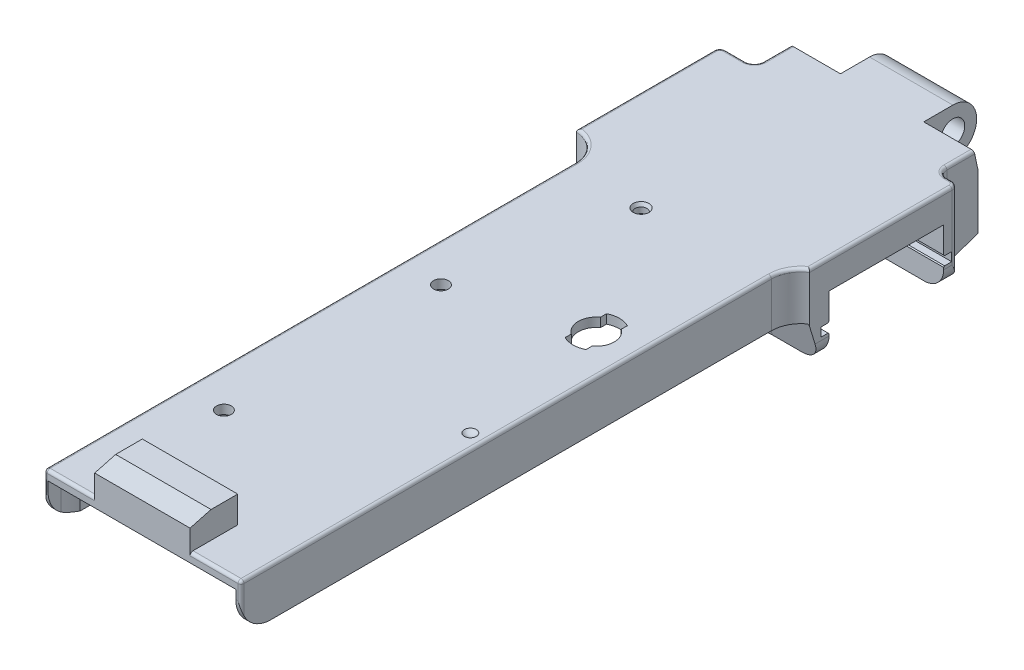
from build123d import *

# Parameters (mm, degrees)
SKETCH_1_R          = 3.175
EXTRUDE_1_DEPTH     = 63.3984
SKETCH_2_R          = 1.9685
SKETCH_2_R_2        = 1.5748
CUT_EXTRUDE_1_DEPTH = 217.447445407
CUT_EXTRUDE_2_DEPTH = 10.4902
CUT_EXTRUDE_3_DEPTH = 22.479
CUT_EXTRUDE_4_DEPTH = 18.7452
SKETCH_6_W          = 13.5763
SKETCH_6_H          = 7.112
SKETCH_6_W_2        = 13.4239
CUT_EXTRUDE_5_DEPTH = 209.938252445
CUT_EXTRUDE_6_DEPTH = 20.7772
CUT_EXTRUDE_7_DEPTH = 13.6906
CUT_EXTRUDE_START   = 12.8524
SKETCH_9_R          = 16.66875
CUT_EXTRUDE_8_DEPTH = 4.953
CHAMFER_1_SIZE      = 0.889
CHAMFER_1_SIZE2     = 0.513264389
CUT_EXTRUDE_9_DEPTH = 222.032085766
FILLET_1_R          = 0.79375


with BuildPart() as part:
    # Sketch 1 → Extrude 1 (new body)
    with BuildSketch(Plane(origin=(0, 0, 0), x_dir=(0, 0, -1), z_dir=(1, 0, 0))):
        with BuildLine():
            Line((0, 6.35), (-192.024, 6.35))
            Line((-192.024, 6.35), (-192.024, 13.462))
            Line((-192.024, 13.462), (-199.13114866, 13.462))
            Line((-199.13114866, 13.462), (-204.724, 11.9634))
            Line((-204.724, 11.9634), (-204.724, 6.35))
            Line((-204.724, 6.35), (-204.724, 1.5875))
            ThreePointArc((-204.724, 1.5875), (-202.399160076, -4.025160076), (-196.7865, -6.35))
            Line((-196.7865, -6.35), (-84.169675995, -6.35))
            Line((-84.169675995, -6.35), (-80.9625, -16.8402))
            Line((-80.9625, -16.8402), (-51.7144, -16.8402))
            Line((-51.7144, -16.8402), (-51.7144, -11.1252))
            Line((-51.7144, -11.1252), (-51.9684, -10.8712))
            Line((-51.9684, -10.8712), (-53.848, -10.8712))
            Line((-53.848, -10.8712), (-53.848, -8.5344))
            Line((-53.848, -8.5344), (-51.9684, -8.5344))
            Line((-51.9684, -8.5344), (-51.7144, -8.2804))
            Line((-51.7144, -8.2804), (-51.7144, -1.2954))
            Line((-51.7144, -1.2954), (-21.1836, -1.2954))
            Line((-21.1836, -1.2954), (-21.1836, -8.2804))
            Line((-21.1836, -8.2804), (-20.9296, -8.5344))
            Line((-20.9296, -8.5344), (-19.05, -8.5344))
            Line((-19.05, -8.5344), (-19.05, -10.8712))
            Line((-19.05, -10.8712), (-20.9296, -10.8712))
            Line((-20.9296, -10.8712), (-21.1836, -11.1252))
            Line((-21.1836, -11.1252), (-21.1836, -16.8402))
            Line((-21.1836, -16.8402), (-17.3736, -16.8402))
            Line((-17.3736, -16.8402), (-6.7056, -13.166913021))
            Line((-6.7056, -13.166913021), (-6.7056, -6.35))
            Line((-6.7056, -6.35), (0, -6.35))
            ThreePointArc((0, -6.35), (6.35, 0), (0, 6.35))
        make_face()
        Circle(SKETCH_1_R, mode=Mode.SUBTRACT)
    extrude(amount=EXTRUDE_1_DEPTH)

    # Sketch 2 → Cut-Extrude 1 (cut, through all)
    with BuildSketch(Plane(origin=(0, 13.462, 0), x_dir=(1, 0, 0), z_dir=(0, 1, 0))):
        with Locations(Location((17.9578, -167.4114, 0), (0, 0, 270))):
            Circle(SKETCH_2_R)
        with Locations(Location((17.9578, -109.601, 0), (0, 0, 270))):
            Circle(SKETCH_2_R)
        with Locations(Location((26.8732, -65.2272, 0), (0, 0, 270))):
            Circle(SKETCH_2_R_2)
        with BuildLine():
            Line((0, 6.35), (22.479, 6.35))
            Line((22.479, 6.35), (22.479, -6.7056))
            Line((22.479, -6.7056), (9.1694, -6.7056))
            Line((9.1694, -6.7056), (9.1694, -14.99235))
            ThreePointArc((9.1694, -14.99235), (8.471948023, -16.676148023), (6.78815, -17.3736))
            Line((6.78815, -17.3736), (1.5875, -17.3736))
            ThreePointArc((1.5875, -17.3736), (0.464967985, -17.838567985), (0, -18.9611))
            Line((0, -18.9611), (0, 6.35))
        make_face()
        with BuildLine():
            Line((0, -204.724), (8.23595, -204.724))
            ThreePointArc((8.23595, -204.724), (7.674683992, -204.491516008), (7.4422, -203.93025))
            Line((7.4422, -203.93025), (7.4422, -63.5))
            ThreePointArc((7.4422, -63.5), (5.289825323, -58.065275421), (0, -55.577968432))
            Line((0, -55.577968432), (0, -204.724))
        make_face()
        with BuildLine():
            Line((63.3984, 6.35), (63.3984, -18.9611))
            ThreePointArc((63.3984, -18.9611), (62.933432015, -17.838567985), (61.8109, -17.3736))
            Line((61.8109, -17.3736), (60.44565, -17.3736))
            ThreePointArc((60.44565, -17.3736), (58.761851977, -16.676148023), (58.0644, -14.99235))
            Line((58.0644, -14.99235), (58.0644, -6.7056))
            Line((58.0644, -6.7056), (44.6532, -6.7056))
            Line((44.6532, -6.7056), (44.6532, 6.35))
            Line((44.6532, 6.35), (63.3984, 6.35))
        make_face()
        with BuildLine():
            Line((59.8424, -203.93025), (59.8424, -63.5))
            ThreePointArc((59.8424, -63.5), (60.787687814, -59.743289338), (63.3984, -56.881362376))
            Line((63.3984, -56.881362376), (63.3984, -204.724))
            Line((63.3984, -204.724), (59.04865, -204.724))
            ThreePointArc((59.04865, -204.724), (59.609916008, -204.491516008), (59.8424, -203.93025))
        make_face()
        with BuildLine():
            Line((46.6598, -94.218191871), (46.6598, -95.837516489))
            ThreePointArc((46.6598, -95.837516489), (44.65955, -99.7204), (46.6598, -103.603283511))
            Line((46.6598, -103.603283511), (46.6598, -105.222608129))
            ThreePointArc((46.6598, -105.222608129), (49.4284, -105.8799), (52.197, -105.222608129))
            Line((52.197, -105.222608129), (52.197, -103.603283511))
            ThreePointArc((52.197, -103.603283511), (54.19725, -99.7204), (52.197, -95.837516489))
            Line((52.197, -95.837516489), (52.197, -94.218191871))
            ThreePointArc((52.197, -94.218191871), (49.4284, -93.5609), (46.6598, -94.218191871))
        make_face()
    extrude(amount=-CUT_EXTRUDE_1_DEPTH, mode=Mode.SUBTRACT)

    # Sketch 3 → Cut-Extrude 2 (cut)
    with BuildSketch(Plane.XZ.offset(16.8402)):
        with BuildLine():
            Line((10.6934, -6.35), (56.7944, -6.35))
            Line((56.7944, -6.35), (56.7944, 7.8486))
            ThreePointArc((56.7944, 7.8486), (54.004592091, 14.583792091), (47.2694, 17.3736))
            Line((47.2694, 17.3736), (20.2184, 17.3736))
            ThreePointArc((20.2184, 17.3736), (13.483207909, 14.583792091), (10.6934, 7.8486))
            Line((10.6934, 7.8486), (10.6934, -6.35))
        make_face()
    extrude(amount=-CUT_EXTRUDE_2_DEPTH, mode=Mode.SUBTRACT)

    # Sketch 4 → Cut-Extrude 3 (cut)
    with BuildSketch(Plane.ZY):
        Polygon((6.7056, 1.450598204), (6.7056, 6.35), (7.747, 6.35), align=None)
    extrude(amount=-CUT_EXTRUDE_3_DEPTH, mode=Mode.SUBTRACT)

    # Sketch 5 → Cut-Extrude 4 (cut)
    with BuildSketch(Plane(origin=(63.3984, 0, 0), x_dir=(0, 0, -1), z_dir=(1, 0, 0))):
        Polygon((-6.7056, 1.450598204), (-6.7056, 6.35), (-7.747, 6.35), align=None)
    extrude(amount=-CUT_EXTRUDE_4_DEPTH, mode=Mode.SUBTRACT)

    # Sketch 6 → Cut-Extrude 5 (cut, through all)
    with BuildSketch(Plane(origin=(0, 0, 192.024), x_dir=(-1, 0, 0), z_dir=(0, 0, -1))):
        with Locations((-53.05425, 9.906)):
            Rectangle(SKETCH_6_W, SKETCH_6_H)
        with Locations((-14.15415, 9.906)):
            Rectangle(SKETCH_6_W_2, SKETCH_6_H)
    extrude(amount=-CUT_EXTRUDE_5_DEPTH, mode=Mode.SUBTRACT)

    # Sketch 7 → Cut-Extrude 6 (cut)
    with BuildSketch(Plane(origin=(0, -16.8402, 0), x_dir=(-1, 0, 0), z_dir=(0, -1, 0))):
        with BuildLine():
            Line((-55.6006, -178.59375), (-55.6006, -102.069179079))
            ThreePointArc((-55.6006, -102.069179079), (-56.0324, -99.7204), (-55.6006, -97.371620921))
            Line((-55.6006, -97.371620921), (-55.6006, -64.135))
            ThreePointArc((-55.6006, -64.135), (-52.810792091, -57.399807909), (-46.0756, -54.61))
            Line((-46.0756, -54.61), (-21.1836, -54.61))
            ThreePointArc((-21.1836, -54.61), (-14.448407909, -57.399807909), (-11.6586, -64.135))
            Line((-11.6586, -64.135), (-11.6586, -194.070997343))
            ThreePointArc((-11.6586, -194.070997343), (-9.2766277, -197.296074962), (-8.4328, -201.215625))
            Line((-8.4328, -201.215625), (-8.4328, -204.724))
            Line((-8.4328, -204.724), (-58.4454, -204.724))
            Line((-58.4454, -204.724), (-58.4454, -201.215625))
            ThreePointArc((-58.4454, -201.215625), (-57.402464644, -196.882011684), (-54.50205, -193.497412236))
            ThreePointArc((-54.50205, -193.497412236), (-53.535245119, -192.369212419), (-53.1876, -190.924674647))
            Line((-53.1876, -190.924674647), (-53.1876, -186.041409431))
            ThreePointArc((-53.1876, -186.041409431), (-53.342175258, -185.062808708), (-53.79085, -184.179494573))
            ThreePointArc((-53.79085, -184.179494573), (-55.136874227, -181.529552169), (-55.6006, -178.59375))
        make_face()
    extrude(amount=-CUT_EXTRUDE_6_DEPTH, mode=Mode.SUBTRACT)

    # Sketch 8 → Cut-Extrude 7 (cut)
    with BuildSketch(Plane.XZ.offset(16.8402)):
        with BuildLine():
            Line((58.4454, 189.70625), (58.4454, 64.135))
            ThreePointArc((58.4454, 64.135), (55.655592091, 57.399807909), (48.9204, 54.61))
            Line((48.9204, 54.61), (22.479, 54.61))
            Line((22.479, 54.61), (22.479, 65.484375))
            Line((22.479, 65.484375), (18.3134, 65.484375))
            ThreePointArc((18.3134, 65.484375), (11.578207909, 68.274182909), (8.7884, 75.009375))
            Line((8.7884, 75.009375), (8.7884, 189.70625))
            ThreePointArc((8.7884, 189.70625), (8.935587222, 191.374258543), (9.3726, 192.990716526))
            Line((9.3726, 192.990716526), (9.3726, 197.090098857))
            ThreePointArc((9.3726, 197.090098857), (8.670721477, 199.100016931), (8.4328, 201.215625))
            Line((8.4328, 201.215625), (8.4328, 204.724))
            Line((8.4328, 204.724), (58.4454, 204.724))
            Line((58.4454, 204.724), (58.4454, 201.215625))
            ThreePointArc((58.4454, 201.215625), (58.400845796, 200.295422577), (58.2676, 199.383828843))
            Line((58.2676, 199.383828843), (58.2676, 191.538046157))
            ThreePointArc((58.2676, 191.538046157), (58.400845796, 190.626452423), (58.4454, 189.70625))
        make_face()
    extrude(amount=-CUT_EXTRUDE_7_DEPTH, mode=Mode.SUBTRACT)

    # Sketch 9 → Cut-Extrude 8 (cut)
    with BuildSketch(Plane.XZ.offset(-6.35).offset(CUT_EXTRUDE_START)):
        with Locations((41.3131, 60.300118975)):
            Circle(SKETCH_9_R)
    extrude(amount=-CUT_EXTRUDE_8_DEPTH, mode=Mode.SUBTRACT)

    # Chamfer 1
    chamfer_1_edges = [part.edges().sort_by_distance(p)[0] for p in [
        (26.8732, 6.35, 63.6524),
    ]]
    chamfer_1_side = [part.faces().sort_by_distance(p)[0] for p in [
        (26.8732, 5.1435, 63.6524),
    ]]
    chamfer(chamfer_1_edges, length=CHAMFER_1_SIZE, length2=CHAMFER_1_SIZE2, reference=chamfer_1_side[0])

    # Sweep 1: sweep along a path in Sketch 10
    with BuildLine(Plane(origin=(63.3984, 0, 0), x_dir=(0, 0, -1), z_dir=(1, 0, 0))) as sweep_1_path:
        Line((-53.848, -16.8402), (-57.055175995, -6.35))
    # Sketch 11 → Sweep 1 (sweep, cut)
    with BuildSketch(Plane.XZ.offset(16.8402)):
        with BuildLine():
            Line((50.462672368, 53.848), (63.3984, 53.848))
            Line((63.3984, 53.848), (63.3984, 98.228236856))
            Line((63.3984, 98.228236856), (46.72965, 98.228236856))
            Line((46.72965, 98.228236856), (46.72965, 54.61))
            ThreePointArc((46.72965, 54.61), (48.557672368, 54.04044408), (50.462672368, 53.848))
        make_face()
    sweep(path=sweep_1_path.line, mode=Mode.SUBTRACT)

    # Sketch 12 → Cut-Extrude 9 (cut, through all)
    with BuildSketch(Plane.XY.offset(204.724)):
        with BuildLine():
            Line((63.3984, -11.680825), (63.3984, -16.8402))
            Line((63.3984, -16.8402), (58.239025, -16.8402))
            ThreePointArc((58.239025, -16.8402), (61.887254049, -15.329054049), (63.3984, -11.680825))
        make_face()
        with BuildLine():
            Line((5.159375, -16.8402), (0, -16.8402))
            Line((0, -16.8402), (0, -11.680825))
            ThreePointArc((0, -11.680825), (1.511145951, -15.329054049), (5.159375, -16.8402))
        make_face()
    extrude(amount=-CUT_EXTRUDE_9_DEPTH, mode=Mode.SUBTRACT)

    # Fillet 1
    fillet_1_edges = [part.edges().sort_by_distance(p)[0] for p in [
        (60.787687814, 6.35, 59.743289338),
        (59.8424, 6.35, 133.715125),
        (5.289825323, 6.35, 58.065275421),
        (7.4422, 6.35, 133.715125),
        (63.3984, 6.35, 37.921231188),
        (58.0644, 6.35, 11.369675),
        (58.761851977, 6.35, 16.676148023),
        (61.128275, 6.35, 17.3736),
        (62.933432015, 6.35, 17.838567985),
        (9.1694, 6.35, 11.369675),
        (59.609916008, 6.35, 204.491516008),
        (52.657375, 6.35, 204.724),
        (7.674683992, 6.35, 204.491516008),
        (14.551025, 6.35, 204.724),
        (0, 6.35, 37.269534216),
        (0.464967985, 6.35, 17.838567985),
        (4.187825, 6.35, 17.3736),
        (8.471948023, 6.35, 16.676148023),
    ]]
    fillet(fillet_1_edges, radius=FILLET_1_R)

    # Sketch 13 → Cut-Revolve 1 (revolve, cut)
    with BuildSketch(Plane(origin=(56.0324, 0, 0), x_dir=(0, 0, -1), z_dir=(1, 0, 0))):
        with BuildLine():
            Line((-139.8524, 6.35), (-138.2649, 6.35))
            ThreePointArc((-138.2649, 6.35), (-138.997505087, 5.879637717), (-139.8524, 5.715))
            Line((-139.8524, 5.715), (-139.8524, 6.35))
        make_face()
    revolve(axis=Axis((56.0324, 11.948104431, 139.8524), (0, -1, 0)), mode=Mode.SUBTRACT)


solid = part.part
